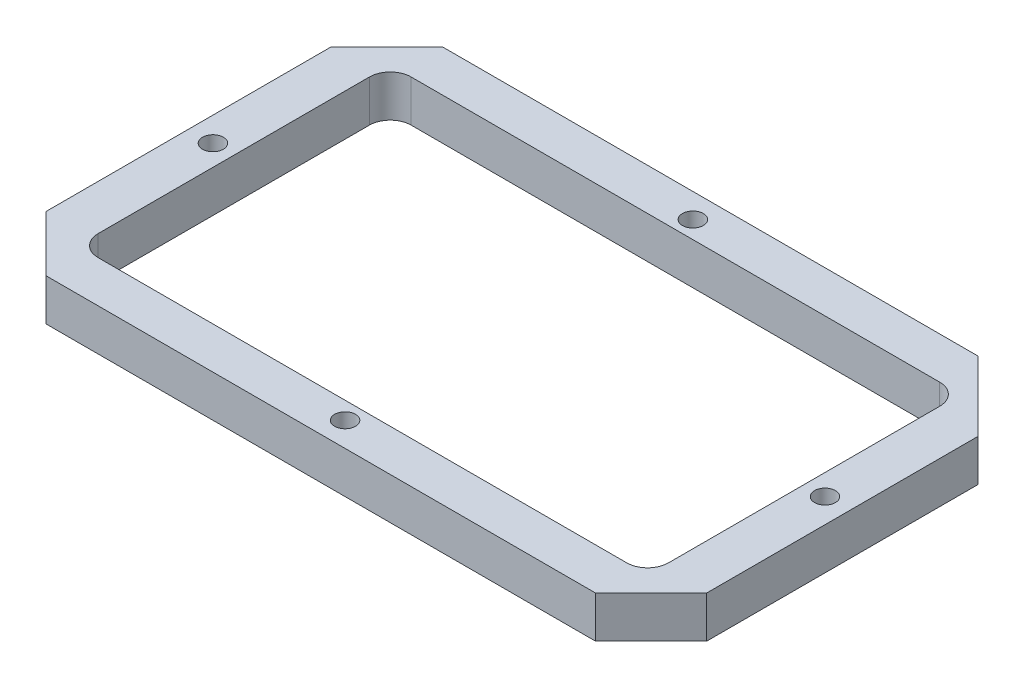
from build123d import *

# Parameters (mm, degrees)
SKIZZE1_R                            = 1.5
AUFSATZ_LINEAR_AUSTRAGEN1_DEPTH      = 6
SCHNITT_LINEAR_AUSTRAGEN1_REACH      = 103.482
SCHNITT_LINEAR_AUSTRAGEN1_END_RADIUS = 3
SKIZZE2_R                            = 1


with BuildPart() as part:
    # Skizze1 → Aufsatz-Linear austragen1 (new body)
    with BuildSketch(Plane(origin=(0, 0, 0), x_dir=(1, 0, 0), z_dir=(0, 1, 0))):
        Polygon((37.5, 28.5), (47.5, 18.5), (47.5, -20.5), (39.5, -28.5), (-39.5, -28.5), (-47.5, -20.5), (-47.5, 20.5), (-39.5, 28.5), align=None)
        with Locations(Location((0, 25, 0), (0, 0, 270))):
            Circle(SKIZZE1_R, mode=Mode.SUBTRACT)
        with Locations(Location((0, -25, 0), (0, 0, 90))):
            Circle(SKIZZE1_R, mode=Mode.SUBTRACT)
        with Locations(Location((-44, 0, 0), (0, 0, 270))):
            Circle(SKIZZE1_R, mode=Mode.SUBTRACT)
        with Locations(Location((44, 0, 0), (0, 0, 90))):
            Circle(SKIZZE1_R, mode=Mode.SUBTRACT)
        with BuildLine():
            Line((-38, 22.5), (38, 22.5))
            ThreePointArc((38, 22.5), (40.121320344, 21.621320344), (41, 19.5))
            Line((41, 19.5), (41, -19.5))
            ThreePointArc((41, -19.5), (40.121320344, -21.621320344), (38, -22.5))
            Line((38, -22.5), (-38, -22.5))
            ThreePointArc((-38, -22.5), (-40.121320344, -21.621320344), (-41, -19.5))
            Line((-41, -19.5), (-41, 19.5))
            ThreePointArc((-41, 19.5), (-40.121320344, 21.621320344), (-38, 22.5))
        make_face(mode=Mode.SUBTRACT)
    extrude(amount=AUFSATZ_LINEAR_AUSTRAGEN1_DEPTH)

    # Schnitt-Linear austragen1: up to this cylinder (the profile starts outside it)
    schnitt_linear_austragen1_end = Plane(origin=(38, 3, -19.5), z_dir=(0, -1, 0)) * Cylinder(SCHNITT_LINEAR_AUSTRAGEN1_END_RADIUS, 213.964, mode=Mode.PRIVATE)
    # Skizze2 → Schnitt-Linear austragen1 (cut, up to the surface)
    with BuildSketch(Plane(origin=(33, 0, -33), x_dir=(-0.7071067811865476, 0, -0.7071067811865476), z_dir=(0.7071067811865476, 0, -0.7071067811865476)), mode=Mode.PRIVATE) as schnitt_linear_austragen1_sk1:
        with Locations((-13.435028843, 3)):
            Circle(SKIZZE2_R)
    schnitt_linear_austragen1_tool1 = extrude(schnitt_linear_austragen1_sk1.sketch, amount=-SCHNITT_LINEAR_AUSTRAGEN1_REACH, mode=Mode.PRIVATE) - schnitt_linear_austragen1_end
    add(schnitt_linear_austragen1_tool1.solids().sort_by_distance((42.5, 3, -23.5))[0], mode=Mode.SUBTRACT)


solid = part.part
